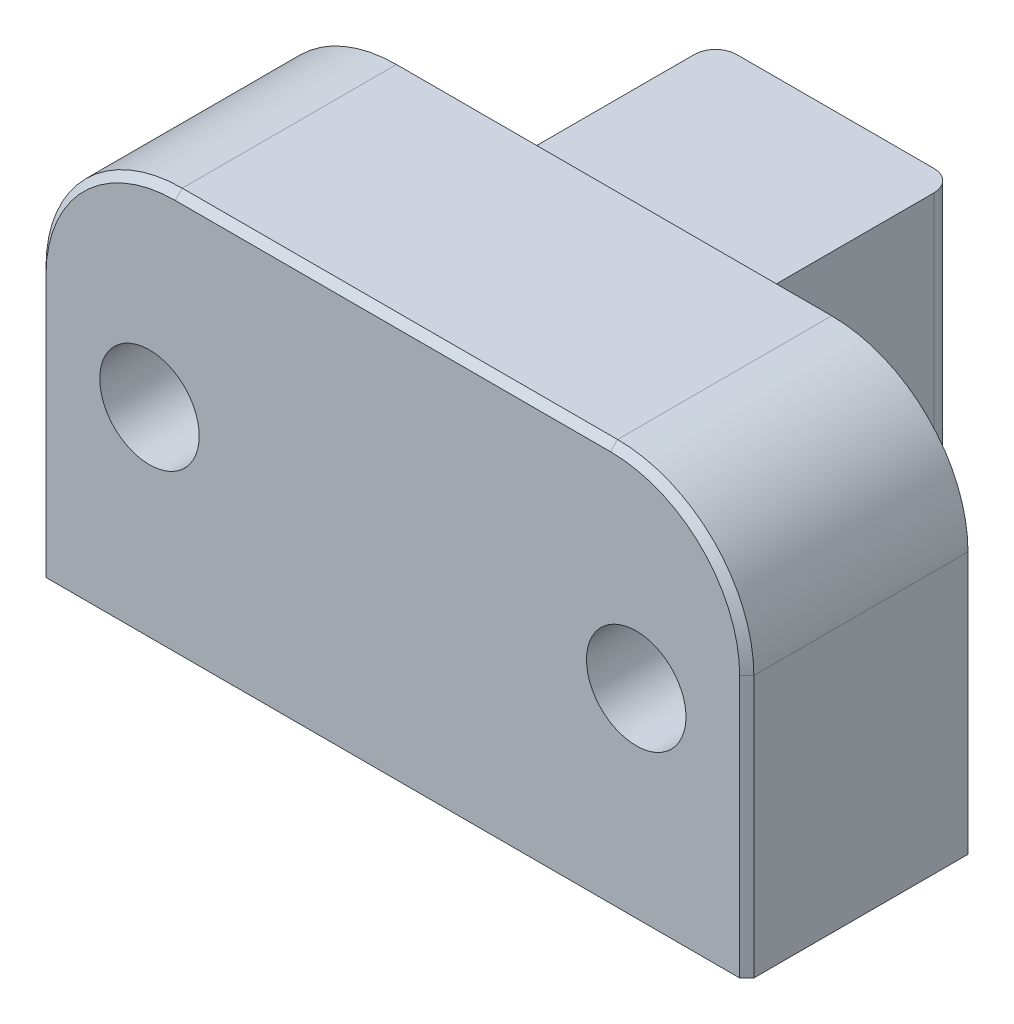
ISO-10303-21;
HEADER;
FILE_DESCRIPTION(('STEP AP214'),'2;1');
FILE_NAME('part.step','',(''),(''),'','','');
FILE_SCHEMA(('AUTOMOTIVE_DESIGN { 1 0 10303 214 1 1 1 1 }'));
ENDSEC;
DATA;
#1=APPLICATION_CONTEXT('core data for automotive mechanical design processes');
#2=APPLICATION_PROTOCOL_DEFINITION('international standard','automotive_design',2000,#1);
#3=PRODUCT_CONTEXT('',#1,'mechanical');
#4=PRODUCT('Part','Part','',(#3));
#5=PRODUCT_RELATED_PRODUCT_CATEGORY('part','',(#4));
#6=PRODUCT_DEFINITION_FORMATION('','',#4);
#7=PRODUCT_DEFINITION_CONTEXT('part definition',#1,'design');
#8=PRODUCT_DEFINITION('design','',#6,#7);
#9=PRODUCT_DEFINITION_SHAPE('','',#8);
#10=(LENGTH_UNIT() NAMED_UNIT(*) SI_UNIT(.MILLI.,.METRE.));
#11=(NAMED_UNIT(*) PLANE_ANGLE_UNIT() SI_UNIT($,.RADIAN.));
#12=(NAMED_UNIT(*) SI_UNIT($,.STERADIAN.) SOLID_ANGLE_UNIT());
#13=UNCERTAINTY_MEASURE_WITH_UNIT(LENGTH_MEASURE(1.E-05),#10,'distance_accuracy_value','');
#14=(GEOMETRIC_REPRESENTATION_CONTEXT(3) GLOBAL_UNCERTAINTY_ASSIGNED_CONTEXT((#13)) GLOBAL_UNIT_ASSIGNED_CONTEXT((#10,
#11,#12)) REPRESENTATION_CONTEXT('',''));
#15=CARTESIAN_POINT('',(0.,0.,0.));
#16=DIRECTION('',(0.,0.,1.));
#17=DIRECTION('',(1.,0.,0.));
#18=AXIS2_PLACEMENT_3D('',#15,#16,#17);
#19=CARTESIAN_POINT('',(-25.39365,28.575,0.));
#20=DIRECTION('',(1.,0.,0.));
#21=DIRECTION('',(0.,0.,-1.));
#22=AXIS2_PLACEMENT_3D('',#19,#20,#21);
#23=PLANE('',#22);
#24=DIRECTION('',(0.,0.,1.));
#25=VECTOR('',#24,1.);
#26=CARTESIAN_POINT('',(-25.39365,0.,0.));
#27=LINE('',#26,#25);
#28=CARTESIAN_POINT('',(-25.39365,0.,0.));
#29=VERTEX_POINT('',#28);
#30=CARTESIAN_POINT('',(-25.39365,0.,15.367));
#31=VERTEX_POINT('',#30);
#32=EDGE_CURVE('E178',#29,#31,#27,.T.);
#33=ORIENTED_EDGE('',*,*,#32,.T.);
#34=DIRECTION('',(0.,1.,0.));
#35=VECTOR('',#34,1.);
#36=CARTESIAN_POINT('',(-25.39365,28.575,15.367));
#37=LINE('',#36,#35);
#38=CARTESIAN_POINT('',(-25.39365,18.796,15.367));
#39=VERTEX_POINT('',#38);
#40=EDGE_CURVE('E252',#31,#39,#37,.T.);
#41=ORIENTED_EDGE('',*,*,#40,.T.);
#42=DIRECTION('',(0.,0.,1.));
#43=VECTOR('',#42,1.);
#44=CARTESIAN_POINT('',(-25.39365,18.796,0.));
#45=LINE('',#44,#43);
#46=CARTESIAN_POINT('',(-25.39365,18.796,0.));
#47=VERTEX_POINT('',#46);
#48=EDGE_CURVE('E235',#39,#47,#45,.F.);
#49=ORIENTED_EDGE('',*,*,#48,.T.);
#50=DIRECTION('',(0.,-1.,0.));
#51=VECTOR('',#50,1.);
#52=CARTESIAN_POINT('',(-25.39365,28.575,0.));
#53=LINE('',#52,#51);
#54=EDGE_CURVE('E173',#47,#29,#53,.T.);
#55=ORIENTED_EDGE('',*,*,#54,.T.);
#56=EDGE_LOOP('',(#33,#41,#49,#55));
#57=FACE_BOUND('',#56,.T.);
#58=ADVANCED_FACE('F32',(#57),#23,.F.);
#59=CARTESIAN_POINT('',(-25.39365,28.575,15.875));
#60=DIRECTION('',(0.,0.,-1.));
#61=DIRECTION('',(-1.,0.,0.));
#62=AXIS2_PLACEMENT_3D('',#59,#60,#61);
#63=PLANE('',#62);
#64=CARTESIAN_POINT('',(17.4625,14.2875,15.875));
#65=DIRECTION('',(0.,0.,-1.));
#66=DIRECTION('',(-1.,0.,0.));
#67=AXIS2_PLACEMENT_3D('',#64,#65,#66);
#68=CIRCLE('',#67,3.5687);
#69=CARTESIAN_POINT('',(13.8938,14.2875,15.875));
#70=VERTEX_POINT('',#69);
#71=EDGE_CURVE('E284',#70,#70,#68,.T.);
#72=ORIENTED_EDGE('',*,*,#71,.T.);
#73=EDGE_LOOP('',(#72));
#74=FACE_BOUND('',#73,.T.);
#75=CARTESIAN_POINT('',(-17.4625,14.2875,15.875));
#76=DIRECTION('',(0.,0.,1.));
#77=DIRECTION('',(1.,0.,0.));
#78=AXIS2_PLACEMENT_3D('',#75,#76,#77);
#79=CIRCLE('',#78,3.5687);
#80=CARTESIAN_POINT('',(-13.8938,14.2875,15.875));
#81=VERTEX_POINT('',#80);
#82=EDGE_CURVE('E296',#81,#81,#79,.T.);
#83=ORIENTED_EDGE('',*,*,#82,.F.);
#84=EDGE_LOOP('',(#83));
#85=FACE_BOUND('',#84,.T.);
#86=CARTESIAN_POINT('',(-15.61465,18.796,15.875));
#87=DIRECTION('',(0.,0.,-1.));
#88=DIRECTION('',(-1.,0.,0.));
#89=AXIS2_PLACEMENT_3D('',#86,#87,#88);
#90=CIRCLE('',#89,9.271);
#91=CARTESIAN_POINT('',(-15.61465,28.067,15.875));
#92=VERTEX_POINT('',#91);
#93=CARTESIAN_POINT('',(-24.88565,18.796,15.875));
#94=VERTEX_POINT('',#93);
#95=EDGE_CURVE('E243',#92,#94,#90,.F.);
#96=ORIENTED_EDGE('',*,*,#95,.T.);
#97=DIRECTION('',(0.,-1.,0.));
#98=VECTOR('',#97,1.);
#99=CARTESIAN_POINT('',(-24.88565,28.575,15.875));
#100=LINE('',#99,#98);
#101=CARTESIAN_POINT('',(-24.88565,0.,15.875));
#102=VERTEX_POINT('',#101);
#103=EDGE_CURVE('E245',#94,#102,#100,.T.);
#104=ORIENTED_EDGE('',*,*,#103,.T.);
#105=DIRECTION('',(1.,0.,0.));
#106=VECTOR('',#105,1.);
#107=CARTESIAN_POINT('',(-25.39365,0.,15.875));
#108=LINE('',#107,#106);
#109=CARTESIAN_POINT('',(24.88565,0.,15.875));
#110=VERTEX_POINT('',#109);
#111=EDGE_CURVE('E162',#102,#110,#108,.T.);
#112=ORIENTED_EDGE('',*,*,#111,.T.);
#113=DIRECTION('',(0.,1.,0.));
#114=VECTOR('',#113,1.);
#115=CARTESIAN_POINT('',(24.88565,28.575,15.875));
#116=LINE('',#115,#114);
#117=CARTESIAN_POINT('',(24.88565,18.796,15.875));
#118=VERTEX_POINT('',#117);
#119=EDGE_CURVE('E237',#110,#118,#116,.T.);
#120=ORIENTED_EDGE('',*,*,#119,.T.);
#121=CARTESIAN_POINT('',(15.61465,18.796,15.875));
#122=DIRECTION('',(0.,0.,-1.));
#123=DIRECTION('',(-1.,0.,0.));
#124=AXIS2_PLACEMENT_3D('',#121,#122,#123);
#125=CIRCLE('',#124,9.271);
#126=CARTESIAN_POINT('',(15.61465,28.067,15.875));
#127=VERTEX_POINT('',#126);
#128=EDGE_CURVE('E239',#118,#127,#125,.F.);
#129=ORIENTED_EDGE('',*,*,#128,.T.);
#130=DIRECTION('',(-1.,0.,0.));
#131=VECTOR('',#130,1.);
#132=CARTESIAN_POINT('',(-15.61465,28.067,15.875));
#133=LINE('',#132,#131);
#134=EDGE_CURVE('E241',#127,#92,#133,.T.);
#135=ORIENTED_EDGE('',*,*,#134,.T.);
#136=EDGE_LOOP('',(#96,#104,#112,#120,#129,#135));
#137=FACE_BOUND('',#136,.T.);
#138=ADVANCED_FACE('F322',(#74,#85,#137),#63,.F.);
#139=CARTESIAN_POINT('',(25.39365,28.575,0.));
#140=DIRECTION('',(-1.,0.,0.));
#141=DIRECTION('',(0.,0.,1.));
#142=AXIS2_PLACEMENT_3D('',#139,#140,#141);
#143=PLANE('',#142);
#144=DIRECTION('',(0.,0.,-1.));
#145=VECTOR('',#144,1.);
#146=CARTESIAN_POINT('',(25.39365,18.796,15.875));
#147=LINE('',#146,#145);
#148=CARTESIAN_POINT('',(25.39365,18.796,0.));
#149=VERTEX_POINT('',#148);
#150=CARTESIAN_POINT('',(25.39365,18.796,15.367));
#151=VERTEX_POINT('',#150);
#152=EDGE_CURVE('E233',#149,#151,#147,.F.);
#153=ORIENTED_EDGE('',*,*,#152,.T.);
#154=DIRECTION('',(0.,-1.,0.));
#155=VECTOR('',#154,1.);
#156=CARTESIAN_POINT('',(25.39365,28.575,15.367));
#157=LINE('',#156,#155);
#158=CARTESIAN_POINT('',(25.39365,0.,15.367));
#159=VERTEX_POINT('',#158);
#160=EDGE_CURVE('E11',#151,#159,#157,.T.);
#161=ORIENTED_EDGE('',*,*,#160,.T.);
#162=DIRECTION('',(0.,0.,-1.));
#163=VECTOR('',#162,1.);
#164=CARTESIAN_POINT('',(25.39365,0.,0.));
#165=LINE('',#164,#163);
#166=CARTESIAN_POINT('',(25.39365,0.,0.));
#167=VERTEX_POINT('',#166);
#168=EDGE_CURVE('E153',#159,#167,#165,.T.);
#169=ORIENTED_EDGE('',*,*,#168,.T.);
#170=DIRECTION('',(0.,-1.,0.));
#171=VECTOR('',#170,1.);
#172=CARTESIAN_POINT('',(25.39365,28.575,0.));
#173=LINE('',#172,#171);
#174=EDGE_CURVE('E156',#149,#167,#173,.T.);
#175=ORIENTED_EDGE('',*,*,#174,.F.);
#176=EDGE_LOOP('',(#153,#161,#169,#175));
#177=FACE_BOUND('',#176,.T.);
#178=ADVANCED_FACE('F155',(#177),#143,.F.);
#179=CARTESIAN_POINT('',(8.59790000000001,28.575,-15.875));
#180=DIRECTION('',(-1.,0.,0.));
#181=DIRECTION('',(0.,0.,1.));
#182=AXIS2_PLACEMENT_3D('',#179,#180,#181);
#183=PLANE('',#182);
#184=DIRECTION('',(0.,0.,1.));
#185=VECTOR('',#184,1.);
#186=CARTESIAN_POINT('',(8.59790000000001,25.527,-15.875));
#187=LINE('',#186,#185);
#188=CARTESIAN_POINT('',(8.59790000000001,25.527,-14.351));
#189=VERTEX_POINT('',#188);
#190=CARTESIAN_POINT('',(8.59790000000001,25.527,-0.787400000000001));
#191=VERTEX_POINT('',#190);
#192=EDGE_CURVE('E306',#189,#191,#187,.T.);
#193=ORIENTED_EDGE('',*,*,#192,.T.);
#194=DIRECTION('',(0.,-1.,0.));
#195=VECTOR('',#194,1.);
#196=CARTESIAN_POINT('',(8.59790000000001,3.048,-0.787400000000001));
#197=LINE('',#196,#195);
#198=CARTESIAN_POINT('',(8.59790000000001,3.048,-0.787400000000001));
#199=VERTEX_POINT('',#198);
#200=EDGE_CURVE('E213',#191,#199,#197,.T.);
#201=ORIENTED_EDGE('',*,*,#200,.T.);
#202=DIRECTION('',(0.,0.,-1.));
#203=VECTOR('',#202,1.);
#204=CARTESIAN_POINT('',(8.59790000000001,3.048,-15.875));
#205=LINE('',#204,#203);
#206=CARTESIAN_POINT('',(8.59790000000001,3.048,-14.351));
#207=VERTEX_POINT('',#206);
#208=EDGE_CURVE('E317',#199,#207,#205,.T.);
#209=ORIENTED_EDGE('',*,*,#208,.T.);
#210=DIRECTION('',(0.,-1.,0.));
#211=VECTOR('',#210,1.);
#212=CARTESIAN_POINT('',(8.59790000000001,28.575,-14.351));
#213=LINE('',#212,#211);
#214=EDGE_CURVE('E195',#207,#189,#213,.F.);
#215=ORIENTED_EDGE('',*,*,#214,.T.);
#216=EDGE_LOOP('',(#193,#201,#209,#215));
#217=FACE_BOUND('',#216,.T.);
#218=ADVANCED_FACE('F400',(#217),#183,.F.);
#219=CARTESIAN_POINT('',(-8.5979,28.575,-15.875));
#220=DIRECTION('',(0.,0.,1.));
#221=DIRECTION('',(1.,0.,0.));
#222=AXIS2_PLACEMENT_3D('',#219,#220,#221);
#223=PLANE('',#222);
#224=DIRECTION('',(1.,0.,0.));
#225=VECTOR('',#224,1.);
#226=CARTESIAN_POINT('',(-8.5979,25.527,-15.875));
#227=LINE('',#226,#225);
#228=CARTESIAN_POINT('',(-7.07389999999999,25.527,-15.875));
#229=VERTEX_POINT('',#228);
#230=CARTESIAN_POINT('',(7.0739,25.527,-15.875));
#231=VERTEX_POINT('',#230);
#232=EDGE_CURVE('E303',#229,#231,#227,.T.);
#233=ORIENTED_EDGE('',*,*,#232,.T.);
#234=DIRECTION('',(0.,-1.,0.));
#235=VECTOR('',#234,1.);
#236=CARTESIAN_POINT('',(7.0739,28.575,-15.875));
#237=LINE('',#236,#235);
#238=CARTESIAN_POINT('',(7.0739,3.048,-15.875));
#239=VERTEX_POINT('',#238);
#240=EDGE_CURVE('E187',#231,#239,#237,.T.);
#241=ORIENTED_EDGE('',*,*,#240,.T.);
#242=DIRECTION('',(-1.,0.,0.));
#243=VECTOR('',#242,1.);
#244=CARTESIAN_POINT('',(-8.5979,3.048,-15.875));
#245=LINE('',#244,#243);
#246=CARTESIAN_POINT('',(-7.07389999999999,3.048,-15.875));
#247=VERTEX_POINT('',#246);
#248=EDGE_CURVE('E314',#239,#247,#245,.T.);
#249=ORIENTED_EDGE('',*,*,#248,.T.);
#250=DIRECTION('',(0.,-1.,0.));
#251=VECTOR('',#250,1.);
#252=CARTESIAN_POINT('',(-7.07389999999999,28.575,-15.875));
#253=LINE('',#252,#251);
#254=EDGE_CURVE('E172',#247,#229,#253,.F.);
#255=ORIENTED_EDGE('',*,*,#254,.T.);
#256=EDGE_LOOP('',(#233,#241,#249,#255));
#257=FACE_BOUND('',#256,.T.);
#258=ADVANCED_FACE('F405',(#257),#223,.F.);
#259=CARTESIAN_POINT('',(-8.5979,28.575,-15.875));
#260=DIRECTION('',(1.,0.,0.));
#261=DIRECTION('',(0.,0.,-1.));
#262=AXIS2_PLACEMENT_3D('',#259,#260,#261);
#263=PLANE('',#262);
#264=DIRECTION('',(0.,0.,1.));
#265=VECTOR('',#264,1.);
#266=CARTESIAN_POINT('',(-8.5979,3.048,-15.875));
#267=LINE('',#266,#265);
#268=CARTESIAN_POINT('',(-8.5979,3.048,-14.351));
#269=VERTEX_POINT('',#268);
#270=CARTESIAN_POINT('',(-8.5979,3.048,-0.787400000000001));
#271=VERTEX_POINT('',#270);
#272=EDGE_CURVE('E311',#269,#271,#267,.T.);
#273=ORIENTED_EDGE('',*,*,#272,.T.);
#274=DIRECTION('',(0.,-1.,0.));
#275=VECTOR('',#274,1.);
#276=CARTESIAN_POINT('',(-8.5979,25.527,-0.7874));
#277=LINE('',#276,#275);
#278=CARTESIAN_POINT('',(-8.5979,25.527,-0.787400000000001));
#279=VERTEX_POINT('',#278);
#280=EDGE_CURVE('E211',#271,#279,#277,.F.);
#281=ORIENTED_EDGE('',*,*,#280,.T.);
#282=DIRECTION('',(0.,0.,-1.));
#283=VECTOR('',#282,1.);
#284=CARTESIAN_POINT('',(-8.5979,25.527,-15.875));
#285=LINE('',#284,#283);
#286=CARTESIAN_POINT('',(-8.5979,25.527,-14.351));
#287=VERTEX_POINT('',#286);
#288=EDGE_CURVE('E301',#279,#287,#285,.T.);
#289=ORIENTED_EDGE('',*,*,#288,.T.);
#290=DIRECTION('',(0.,-1.,0.));
#291=VECTOR('',#290,1.);
#292=CARTESIAN_POINT('',(-8.5979,28.575,-14.351));
#293=LINE('',#292,#291);
#294=EDGE_CURVE('E202',#287,#269,#293,.T.);
#295=ORIENTED_EDGE('',*,*,#294,.T.);
#296=EDGE_LOOP('',(#273,#281,#289,#295));
#297=FACE_BOUND('',#296,.T.);
#298=ADVANCED_FACE('F389',(#297),#263,.F.);
#299=CARTESIAN_POINT('',(-25.39365,28.575,0.));
#300=DIRECTION('',(0.,0.,1.));
#301=DIRECTION('',(1.,0.,0.));
#302=AXIS2_PLACEMENT_3D('',#299,#300,#301);
#303=PLANE('',#302);
#304=CARTESIAN_POINT('',(17.4625,14.2875,0.));
#305=DIRECTION('',(0.,0.,-1.));
#306=DIRECTION('',(-1.,0.,0.));
#307=AXIS2_PLACEMENT_3D('',#304,#305,#306);
#308=CIRCLE('',#307,5.1562);
#309=CARTESIAN_POINT('',(12.3063,14.2875,0.));
#310=VERTEX_POINT('',#309);
#311=EDGE_CURVE('E269',#310,#310,#308,.T.);
#312=ORIENTED_EDGE('',*,*,#311,.F.);
#313=EDGE_LOOP('',(#312));
#314=FACE_BOUND('',#313,.T.);
#315=CARTESIAN_POINT('',(-17.4625,14.2875,0.));
#316=DIRECTION('',(0.,0.,1.));
#317=DIRECTION('',(1.,0.,0.));
#318=AXIS2_PLACEMENT_3D('',#315,#316,#317);
#319=CIRCLE('',#318,5.1562);
#320=CARTESIAN_POINT('',(-12.3063,14.2875,0.));
#321=VERTEX_POINT('',#320);
#322=EDGE_CURVE('E287',#321,#321,#319,.T.);
#323=ORIENTED_EDGE('',*,*,#322,.T.);
#324=EDGE_LOOP('',(#323));
#325=FACE_BOUND('',#324,.T.);
#326=DIRECTION('',(0.,-1.,0.));
#327=VECTOR('',#326,1.);
#328=CARTESIAN_POINT('',(-9.3853,3.048,0.));
#329=LINE('',#328,#327);
#330=CARTESIAN_POINT('',(-9.3853,25.527,0.));
#331=VERTEX_POINT('',#330);
#332=CARTESIAN_POINT('',(-9.3853,3.048,0.));
#333=VERTEX_POINT('',#332);
#334=EDGE_CURVE('E208',#331,#333,#329,.T.);
#335=ORIENTED_EDGE('',*,*,#334,.T.);
#336=DIRECTION('',(1.,0.,0.));
#337=VECTOR('',#336,1.);
#338=CARTESIAN_POINT('',(-12.7,3.048,0.));
#339=LINE('',#338,#337);
#340=CARTESIAN_POINT('',(9.38530000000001,3.048,0.));
#341=VERTEX_POINT('',#340);
#342=EDGE_CURVE('E309',#333,#341,#339,.T.);
#343=ORIENTED_EDGE('',*,*,#342,.T.);
#344=DIRECTION('',(0.,-1.,0.));
#345=VECTOR('',#344,1.);
#346=CARTESIAN_POINT('',(9.38530000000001,25.527,0.));
#347=LINE('',#346,#345);
#348=CARTESIAN_POINT('',(9.38530000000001,25.527,0.));
#349=VERTEX_POINT('',#348);
#350=EDGE_CURVE('E205',#341,#349,#347,.F.);
#351=ORIENTED_EDGE('',*,*,#350,.T.);
#352=DIRECTION('',(1.,0.,0.));
#353=VECTOR('',#352,1.);
#354=CARTESIAN_POINT('',(-12.7,25.527,0.));
#355=LINE('',#354,#353);
#356=EDGE_CURVE('E299',#331,#349,#355,.T.);
#357=ORIENTED_EDGE('',*,*,#356,.F.);
#358=EDGE_LOOP('',(#335,#343,#351,#357));
#359=FACE_BOUND('',#358,.T.);
#360=DIRECTION('',(-1.,0.,0.));
#361=VECTOR('',#360,1.);
#362=CARTESIAN_POINT('',(8.59790000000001,28.575,0.));
#363=LINE('',#362,#361);
#364=CARTESIAN_POINT('',(15.61465,28.575,0.));
#365=VERTEX_POINT('',#364);
#366=CARTESIAN_POINT('',(-15.61465,28.575,0.));
#367=VERTEX_POINT('',#366);
#368=EDGE_CURVE('E179',#365,#367,#363,.T.);
#369=ORIENTED_EDGE('',*,*,#368,.F.);
#370=CARTESIAN_POINT('',(15.61465,18.796,0.));
#371=DIRECTION('',(0.,0.,1.));
#372=DIRECTION('',(1.,0.,0.));
#373=AXIS2_PLACEMENT_3D('',#370,#371,#372);
#374=CIRCLE('',#373,9.779);
#375=EDGE_CURVE('E171',#365,#149,#374,.F.);
#376=ORIENTED_EDGE('',*,*,#375,.T.);
#377=ORIENTED_EDGE('',*,*,#174,.T.);
#378=DIRECTION('',(-1.,0.,0.));
#379=VECTOR('',#378,1.);
#380=CARTESIAN_POINT('',(-25.39365,0.,0.));
#381=LINE('',#380,#379);
#382=EDGE_CURVE('E161',#167,#29,#381,.T.);
#383=ORIENTED_EDGE('',*,*,#382,.T.);
#384=ORIENTED_EDGE('',*,*,#54,.F.);
#385=CARTESIAN_POINT('',(-15.61465,18.796,0.));
#386=DIRECTION('',(0.,0.,1.));
#387=DIRECTION('',(1.,0.,0.));
#388=AXIS2_PLACEMENT_3D('',#385,#386,#387);
#389=CIRCLE('',#388,9.779);
#390=EDGE_CURVE('E230',#47,#367,#389,.F.);
#391=ORIENTED_EDGE('',*,*,#390,.T.);
#392=EDGE_LOOP('',(#369,#376,#377,#383,#384,#391));
#393=FACE_BOUND('',#392,.T.);
#394=ADVANCED_FACE('F167',(#314,#325,#359,#393),#303,.F.);
#395=CARTESIAN_POINT('',(-25.39365,28.575,15.875));
#396=DIRECTION('',(0.,1.,0.));
#397=DIRECTION('',(0.,0.,1.));
#398=AXIS2_PLACEMENT_3D('',#395,#396,#397);
#399=PLANE('',#398);
#400=DIRECTION('',(0.,0.,1.));
#401=VECTOR('',#400,1.);
#402=CARTESIAN_POINT('',(-15.61465,28.575,15.875));
#403=LINE('',#402,#401);
#404=CARTESIAN_POINT('',(-15.61465,28.575,15.367));
#405=VERTEX_POINT('',#404);
#406=EDGE_CURVE('E226',#367,#405,#403,.T.);
#407=ORIENTED_EDGE('',*,*,#406,.T.);
#408=DIRECTION('',(1.,0.,0.));
#409=VECTOR('',#408,1.);
#410=CARTESIAN_POINT('',(15.61465,28.575,15.367));
#411=LINE('',#410,#409);
#412=CARTESIAN_POINT('',(15.61465,28.575,15.367));
#413=VERTEX_POINT('',#412);
#414=EDGE_CURVE('E56',#405,#413,#411,.T.);
#415=ORIENTED_EDGE('',*,*,#414,.T.);
#416=DIRECTION('',(0.,0.,-1.));
#417=VECTOR('',#416,1.);
#418=CARTESIAN_POINT('',(15.61465,28.575,0.));
#419=LINE('',#418,#417);
#420=EDGE_CURVE('E228',#413,#365,#419,.T.);
#421=ORIENTED_EDGE('',*,*,#420,.T.);
#422=ORIENTED_EDGE('',*,*,#368,.T.);
#423=EDGE_LOOP('',(#407,#415,#421,#422));
#424=FACE_BOUND('',#423,.T.);
#425=ADVANCED_FACE('F342',(#424),#399,.T.);
#426=CARTESIAN_POINT('',(-25.39365,0.,15.875));
#427=DIRECTION('',(0.,1.,0.));
#428=DIRECTION('',(0.,0.,1.));
#429=AXIS2_PLACEMENT_3D('',#426,#427,#428);
#430=PLANE('',#429);
#431=ORIENTED_EDGE('',*,*,#111,.F.);
#432=DIRECTION('',(0.707106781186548,0.,0.707106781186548));
#433=VECTOR('',#432,1.);
#434=CARTESIAN_POINT('',(-24.88565,0.,15.875));
#435=LINE('',#434,#433);
#436=EDGE_CURVE('E250',#102,#31,#435,.F.);
#437=ORIENTED_EDGE('',*,*,#436,.T.);
#438=ORIENTED_EDGE('',*,*,#32,.F.);
#439=ORIENTED_EDGE('',*,*,#382,.F.);
#440=ORIENTED_EDGE('',*,*,#168,.F.);
#441=DIRECTION('',(0.707106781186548,0.,-0.707106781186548));
#442=VECTOR('',#441,1.);
#443=CARTESIAN_POINT('',(25.39365,0.,15.367));
#444=LINE('',#443,#442);
#445=EDGE_CURVE('E248',#159,#110,#444,.F.);
#446=ORIENTED_EDGE('',*,*,#445,.T.);
#447=EDGE_LOOP('',(#431,#437,#438,#439,#440,#446));
#448=FACE_BOUND('',#447,.T.);
#449=ADVANCED_FACE('F176',(#448),#430,.F.);
#450=CARTESIAN_POINT('',(-12.7,3.048,-25.4));
#451=DIRECTION('',(0.,1.,0.));
#452=DIRECTION('',(0.,0.,1.));
#453=AXIS2_PLACEMENT_3D('',#450,#451,#452);
#454=PLANE('',#453);
#455=ORIENTED_EDGE('',*,*,#248,.F.);
#456=CARTESIAN_POINT('',(7.0739,3.048,-14.351));
#457=DIRECTION('',(0.,1.,0.));
#458=DIRECTION('',(0.,0.,1.));
#459=AXIS2_PLACEMENT_3D('',#456,#457,#458);
#460=CIRCLE('',#459,1.524);
#461=EDGE_CURVE('E192',#239,#207,#460,.F.);
#462=ORIENTED_EDGE('',*,*,#461,.T.);
#463=ORIENTED_EDGE('',*,*,#208,.F.);
#464=CARTESIAN_POINT('',(9.38530000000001,3.048,-0.787400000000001));
#465=DIRECTION('',(0.,1.,0.));
#466=DIRECTION('',(0.,0.,1.));
#467=AXIS2_PLACEMENT_3D('',#464,#465,#466);
#468=CIRCLE('',#467,0.7874);
#469=EDGE_CURVE('E221',#199,#341,#468,.T.);
#470=ORIENTED_EDGE('',*,*,#469,.T.);
#471=ORIENTED_EDGE('',*,*,#342,.F.);
#472=CARTESIAN_POINT('',(-9.3853,3.048,-0.7874));
#473=DIRECTION('',(0.,1.,0.));
#474=DIRECTION('',(0.,0.,1.));
#475=AXIS2_PLACEMENT_3D('',#472,#473,#474);
#476=CIRCLE('',#475,0.7874);
#477=EDGE_CURVE('E216',#333,#271,#476,.T.);
#478=ORIENTED_EDGE('',*,*,#477,.T.);
#479=ORIENTED_EDGE('',*,*,#272,.F.);
#480=CARTESIAN_POINT('',(-7.07389999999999,3.048,-14.351));
#481=DIRECTION('',(0.,1.,0.));
#482=DIRECTION('',(0.,0.,1.));
#483=AXIS2_PLACEMENT_3D('',#480,#481,#482);
#484=CIRCLE('',#483,1.524);
#485=EDGE_CURVE('E190',#269,#247,#484,.F.);
#486=ORIENTED_EDGE('',*,*,#485,.T.);
#487=EDGE_LOOP('',(#455,#462,#463,#470,#471,#478,#479,#486));
#488=FACE_BOUND('',#487,.T.);
#489=ADVANCED_FACE('F393',(#488),#454,.F.);
#490=CARTESIAN_POINT('',(-12.7,25.527,-25.4));
#491=DIRECTION('',(0.,-1.,0.));
#492=DIRECTION('',(0.,0.,-1.));
#493=AXIS2_PLACEMENT_3D('',#490,#491,#492);
#494=PLANE('',#493);
#495=ORIENTED_EDGE('',*,*,#192,.F.);
#496=CARTESIAN_POINT('',(7.0739,25.527,-14.351));
#497=DIRECTION('',(0.,-1.,0.));
#498=DIRECTION('',(0.,0.,-1.));
#499=AXIS2_PLACEMENT_3D('',#496,#497,#498);
#500=CIRCLE('',#499,1.524);
#501=EDGE_CURVE('E200',#189,#231,#500,.F.);
#502=ORIENTED_EDGE('',*,*,#501,.T.);
#503=ORIENTED_EDGE('',*,*,#232,.F.);
#504=CARTESIAN_POINT('',(-7.07389999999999,25.527,-14.351));
#505=DIRECTION('',(0.,-1.,0.));
#506=DIRECTION('',(0.,0.,-1.));
#507=AXIS2_PLACEMENT_3D('',#504,#505,#506);
#508=CIRCLE('',#507,1.524);
#509=EDGE_CURVE('E197',#229,#287,#508,.F.);
#510=ORIENTED_EDGE('',*,*,#509,.T.);
#511=ORIENTED_EDGE('',*,*,#288,.F.);
#512=CARTESIAN_POINT('',(-9.3853,25.527,-0.7874));
#513=DIRECTION('',(0.,-1.,0.));
#514=DIRECTION('',(0.,0.,-1.));
#515=AXIS2_PLACEMENT_3D('',#512,#513,#514);
#516=CIRCLE('',#515,0.7874);
#517=EDGE_CURVE('E218',#279,#331,#516,.T.);
#518=ORIENTED_EDGE('',*,*,#517,.T.);
#519=ORIENTED_EDGE('',*,*,#356,.T.);
#520=CARTESIAN_POINT('',(9.38530000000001,25.527,-0.787400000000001));
#521=DIRECTION('',(0.,-1.,0.));
#522=DIRECTION('',(0.,0.,-1.));
#523=AXIS2_PLACEMENT_3D('',#520,#521,#522);
#524=CIRCLE('',#523,0.7874);
#525=EDGE_CURVE('E224',#349,#191,#524,.T.);
#526=ORIENTED_EDGE('',*,*,#525,.T.);
#527=EDGE_LOOP('',(#495,#502,#503,#510,#511,#518,#519,#526));
#528=FACE_BOUND('',#527,.T.);
#529=ADVANCED_FACE('F369',(#528),#494,.F.);
#530=CARTESIAN_POINT('',(7.0739,28.575,-14.351));
#531=DIRECTION('',(0.,-1.,0.));
#532=DIRECTION('',(0.,0.,-1.));
#533=AXIS2_PLACEMENT_3D('',#530,#531,#532);
#534=CYLINDRICAL_SURFACE('',#533,1.524);
#535=ORIENTED_EDGE('',*,*,#501,.F.);
#536=ORIENTED_EDGE('',*,*,#214,.F.);
#537=ORIENTED_EDGE('',*,*,#461,.F.);
#538=ORIENTED_EDGE('',*,*,#240,.F.);
#539=EDGE_LOOP('',(#535,#536,#537,#538));
#540=FACE_BOUND('',#539,.T.);
#541=ADVANCED_FACE('F365',(#540),#534,.T.);
#542=CARTESIAN_POINT('',(-7.07389999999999,28.575,-14.351));
#543=DIRECTION('',(0.,-1.,0.));
#544=DIRECTION('',(0.,0.,-1.));
#545=AXIS2_PLACEMENT_3D('',#542,#543,#544);
#546=CYLINDRICAL_SURFACE('',#545,1.524);
#547=ORIENTED_EDGE('',*,*,#509,.F.);
#548=ORIENTED_EDGE('',*,*,#254,.F.);
#549=ORIENTED_EDGE('',*,*,#485,.F.);
#550=ORIENTED_EDGE('',*,*,#294,.F.);
#551=EDGE_LOOP('',(#547,#548,#549,#550));
#552=FACE_BOUND('',#551,.T.);
#553=ADVANCED_FACE('F368',(#552),#546,.T.);
#554=CARTESIAN_POINT('',(-9.3853,28.575,-0.7874));
#555=DIRECTION('',(0.,1.,0.));
#556=DIRECTION('',(0.,0.,1.));
#557=AXIS2_PLACEMENT_3D('',#554,#555,#556);
#558=CYLINDRICAL_SURFACE('',#557,0.7874);
#559=ORIENTED_EDGE('',*,*,#517,.F.);
#560=ORIENTED_EDGE('',*,*,#280,.F.);
#561=ORIENTED_EDGE('',*,*,#477,.F.);
#562=ORIENTED_EDGE('',*,*,#334,.F.);
#563=EDGE_LOOP('',(#559,#560,#561,#562));
#564=FACE_BOUND('',#563,.T.);
#565=ADVANCED_FACE('F353',(#564),#558,.F.);
#566=CARTESIAN_POINT('',(9.38530000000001,28.575,-0.787400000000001));
#567=DIRECTION('',(0.,1.,0.));
#568=DIRECTION('',(0.,0.,1.));
#569=AXIS2_PLACEMENT_3D('',#566,#567,#568);
#570=CYLINDRICAL_SURFACE('',#569,0.7874);
#571=ORIENTED_EDGE('',*,*,#525,.F.);
#572=ORIENTED_EDGE('',*,*,#350,.F.);
#573=ORIENTED_EDGE('',*,*,#469,.F.);
#574=ORIENTED_EDGE('',*,*,#200,.F.);
#575=EDGE_LOOP('',(#571,#572,#573,#574));
#576=FACE_BOUND('',#575,.T.);
#577=ADVANCED_FACE('F345',(#576),#570,.F.);
#578=CARTESIAN_POINT('',(15.61465,18.796,15.875));
#579=DIRECTION('',(0.,0.,1.));
#580=DIRECTION('',(1.,0.,0.));
#581=AXIS2_PLACEMENT_3D('',#578,#579,#580);
#582=CYLINDRICAL_SURFACE('',#581,9.779);
#583=ORIENTED_EDGE('',*,*,#420,.F.);
#584=CARTESIAN_POINT('',(15.61465,18.796,15.367));
#585=DIRECTION('',(0.,0.,-1.));
#586=DIRECTION('',(-1.,0.,0.));
#587=AXIS2_PLACEMENT_3D('',#584,#585,#586);
#588=CIRCLE('',#587,9.779);
#589=EDGE_CURVE('E41',#413,#151,#588,.T.);
#590=ORIENTED_EDGE('',*,*,#589,.T.);
#591=ORIENTED_EDGE('',*,*,#152,.F.);
#592=ORIENTED_EDGE('',*,*,#375,.F.);
#593=EDGE_LOOP('',(#583,#590,#591,#592));
#594=FACE_BOUND('',#593,.T.);
#595=ADVANCED_FACE('F343',(#594),#582,.T.);
#596=CARTESIAN_POINT('',(-15.61465,18.796,15.875));
#597=DIRECTION('',(0.,0.,-1.));
#598=DIRECTION('',(-1.,0.,0.));
#599=AXIS2_PLACEMENT_3D('',#596,#597,#598);
#600=CYLINDRICAL_SURFACE('',#599,9.779);
#601=ORIENTED_EDGE('',*,*,#48,.F.);
#602=CARTESIAN_POINT('',(-15.61465,18.796,15.367));
#603=DIRECTION('',(0.,0.,-1.));
#604=DIRECTION('',(-1.,0.,0.));
#605=AXIS2_PLACEMENT_3D('',#602,#603,#604);
#606=CIRCLE('',#605,9.779);
#607=EDGE_CURVE('E254',#39,#405,#606,.T.);
#608=ORIENTED_EDGE('',*,*,#607,.T.);
#609=ORIENTED_EDGE('',*,*,#406,.F.);
#610=ORIENTED_EDGE('',*,*,#390,.F.);
#611=EDGE_LOOP('',(#601,#608,#609,#610));
#612=FACE_BOUND('',#611,.T.);
#613=ADVANCED_FACE('F341',(#612),#600,.T.);
#614=CARTESIAN_POINT('',(-17.4625,14.2875,26.865158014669));
#615=DIRECTION('',(0.,0.,1.));
#616=DIRECTION('',(1.,0.,0.));
#617=AXIS2_PLACEMENT_3D('',#614,#615,#616);
#618=CYLINDRICAL_SURFACE('',#617,3.5687);
#619=CARTESIAN_POINT('',(-17.4625,14.2875,6.7564));
#620=DIRECTION('',(0.,0.,1.));
#621=DIRECTION('',(1.,0.,0.));
#622=AXIS2_PLACEMENT_3D('',#619,#620,#621);
#623=CIRCLE('',#622,3.5687);
#624=CARTESIAN_POINT('',(-13.8938,14.2875,6.7564));
#625=VERTEX_POINT('',#624);
#626=EDGE_CURVE('E293',#625,#625,#623,.T.);
#627=ORIENTED_EDGE('',*,*,#626,.F.);
#628=EDGE_LOOP('',(#627));
#629=FACE_BOUND('',#628,.T.);
#630=ORIENTED_EDGE('',*,*,#82,.T.);
#631=EDGE_LOOP('',(#630));
#632=FACE_BOUND('',#631,.T.);
#633=ADVANCED_FACE('F351',(#629,#632),#618,.F.);
#634=CARTESIAN_POINT('',(-13.8938,14.2875,6.7564));
#635=DIRECTION('',(0.,0.,1.));
#636=DIRECTION('',(1.,0.,0.));
#637=AXIS2_PLACEMENT_3D('',#634,#635,#636);
#638=PLANE('',#637);
#639=CARTESIAN_POINT('',(-17.4625,14.2875,6.7564));
#640=DIRECTION('',(0.,0.,1.));
#641=DIRECTION('',(1.,0.,0.));
#642=AXIS2_PLACEMENT_3D('',#639,#640,#641);
#643=CIRCLE('',#642,5.1562);
#644=CARTESIAN_POINT('',(-12.3063,14.2875,6.7564));
#645=VERTEX_POINT('',#644);
#646=EDGE_CURVE('E290',#645,#645,#643,.T.);
#647=ORIENTED_EDGE('',*,*,#646,.F.);
#648=EDGE_LOOP('',(#647));
#649=FACE_BOUND('',#648,.T.);
#650=ORIENTED_EDGE('',*,*,#626,.T.);
#651=EDGE_LOOP('',(#650));
#652=FACE_BOUND('',#651,.T.);
#653=ADVANCED_FACE('F478',(#649,#652),#638,.F.);
#654=CARTESIAN_POINT('',(-17.4625,14.2875,26.865158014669));
#655=DIRECTION('',(0.,0.,1.));
#656=DIRECTION('',(1.,0.,0.));
#657=AXIS2_PLACEMENT_3D('',#654,#655,#656);
#658=CYLINDRICAL_SURFACE('',#657,5.1562);
#659=ORIENTED_EDGE('',*,*,#322,.F.);
#660=EDGE_LOOP('',(#659));
#661=FACE_BOUND('',#660,.T.);
#662=ORIENTED_EDGE('',*,*,#646,.T.);
#663=EDGE_LOOP('',(#662));
#664=FACE_BOUND('',#663,.T.);
#665=ADVANCED_FACE('F489',(#661,#664),#658,.F.);
#666=CARTESIAN_POINT('',(17.4625,14.2875,26.865158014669));
#667=DIRECTION('',(0.,0.,1.));
#668=DIRECTION('',(-1.,0.,0.));
#669=AXIS2_PLACEMENT_3D('',#666,#667,#668);
#670=CYLINDRICAL_SURFACE('',#669,3.5687);
#671=CARTESIAN_POINT('',(17.4625,14.2875,6.7564));
#672=DIRECTION('',(0.,0.,-1.));
#673=DIRECTION('',(-1.,0.,0.));
#674=AXIS2_PLACEMENT_3D('',#671,#672,#673);
#675=CIRCLE('',#674,3.5687);
#676=CARTESIAN_POINT('',(13.8938,14.2875,6.7564));
#677=VERTEX_POINT('',#676);
#678=EDGE_CURVE('E279',#677,#677,#675,.T.);
#679=ORIENTED_EDGE('',*,*,#678,.T.);
#680=EDGE_LOOP('',(#679));
#681=FACE_BOUND('',#680,.T.);
#682=ORIENTED_EDGE('',*,*,#71,.F.);
#683=EDGE_LOOP('',(#682));
#684=FACE_BOUND('',#683,.T.);
#685=ADVANCED_FACE('F499',(#681,#684),#670,.F.);
#686=CARTESIAN_POINT('',(13.8938,14.2875,6.7564));
#687=DIRECTION('',(0.,0.,1.));
#688=DIRECTION('',(-1.,0.,0.));
#689=AXIS2_PLACEMENT_3D('',#686,#687,#688);
#690=PLANE('',#689);
#691=CARTESIAN_POINT('',(17.4625,14.2875,6.7564));
#692=DIRECTION('',(0.,0.,-1.));
#693=DIRECTION('',(-1.,0.,0.));
#694=AXIS2_PLACEMENT_3D('',#691,#692,#693);
#695=CIRCLE('',#694,5.1562);
#696=CARTESIAN_POINT('',(12.3063,14.2875,6.7564));
#697=VERTEX_POINT('',#696);
#698=EDGE_CURVE('E274',#697,#697,#695,.T.);
#699=ORIENTED_EDGE('',*,*,#698,.T.);
#700=EDGE_LOOP('',(#699));
#701=FACE_BOUND('',#700,.T.);
#702=ORIENTED_EDGE('',*,*,#678,.F.);
#703=EDGE_LOOP('',(#702));
#704=FACE_BOUND('',#703,.T.);
#705=ADVANCED_FACE('F517',(#701,#704),#690,.F.);
#706=CARTESIAN_POINT('',(17.4625,14.2875,26.865158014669));
#707=DIRECTION('',(0.,0.,1.));
#708=DIRECTION('',(-1.,0.,0.));
#709=AXIS2_PLACEMENT_3D('',#706,#707,#708);
#710=CYLINDRICAL_SURFACE('',#709,5.1562);
#711=ORIENTED_EDGE('',*,*,#311,.T.);
#712=EDGE_LOOP('',(#711));
#713=FACE_BOUND('',#712,.T.);
#714=ORIENTED_EDGE('',*,*,#698,.F.);
#715=EDGE_LOOP('',(#714));
#716=FACE_BOUND('',#715,.T.);
#717=ADVANCED_FACE('F527',(#713,#716),#710,.F.);
#718=CARTESIAN_POINT('',(25.39365,28.575,15.367));
#719=DIRECTION('',(-0.707106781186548,0.,-0.707106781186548));
#720=DIRECTION('',(-0.707106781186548,0.,0.707106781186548));
#721=AXIS2_PLACEMENT_3D('',#718,#719,#720);
#722=PLANE('',#721);
#723=ORIENTED_EDGE('',*,*,#445,.F.);
#724=ORIENTED_EDGE('',*,*,#160,.F.);
#725=DIRECTION('',(0.707106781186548,0.,-0.707106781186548));
#726=VECTOR('',#725,1.);
#727=CARTESIAN_POINT('',(24.88565,18.796,15.875));
#728=LINE('',#727,#726);
#729=EDGE_CURVE('E36',#118,#151,#728,.T.);
#730=ORIENTED_EDGE('',*,*,#729,.F.);
#731=ORIENTED_EDGE('',*,*,#119,.F.);
#732=EDGE_LOOP('',(#723,#724,#730,#731));
#733=FACE_BOUND('',#732,.T.);
#734=ADVANCED_FACE('F34',(#733),#722,.F.);
#735=CARTESIAN_POINT('',(15.61465,18.796,15.875));
#736=DIRECTION('',(0.,0.,-1.));
#737=DIRECTION('',(-1.,0.,0.));
#738=AXIS2_PLACEMENT_3D('',#735,#736,#737);
#739=CONICAL_SURFACE('',#738,9.271,0.785398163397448);
#740=ORIENTED_EDGE('',*,*,#729,.T.);
#741=ORIENTED_EDGE('',*,*,#589,.F.);
#742=DIRECTION('',(0.,0.707106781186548,-0.707106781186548));
#743=VECTOR('',#742,1.);
#744=CARTESIAN_POINT('',(15.61465,28.067,15.875));
#745=LINE('',#744,#743);
#746=EDGE_CURVE('E263',#127,#413,#745,.T.);
#747=ORIENTED_EDGE('',*,*,#746,.F.);
#748=ORIENTED_EDGE('',*,*,#128,.F.);
#749=EDGE_LOOP('',(#740,#741,#747,#748));
#750=FACE_BOUND('',#749,.T.);
#751=ADVANCED_FACE('F325',(#750),#739,.T.);
#752=CARTESIAN_POINT('',(-25.39365,28.575,15.367));
#753=DIRECTION('',(0.,0.707106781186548,0.707106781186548));
#754=DIRECTION('',(0.,-0.707106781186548,0.707106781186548));
#755=AXIS2_PLACEMENT_3D('',#752,#753,#754);
#756=PLANE('',#755);
#757=ORIENTED_EDGE('',*,*,#746,.T.);
#758=ORIENTED_EDGE('',*,*,#414,.F.);
#759=DIRECTION('',(0.,0.707106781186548,-0.707106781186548));
#760=VECTOR('',#759,1.);
#761=CARTESIAN_POINT('',(-15.61465,28.067,15.875));
#762=LINE('',#761,#760);
#763=EDGE_CURVE('E261',#92,#405,#762,.T.);
#764=ORIENTED_EDGE('',*,*,#763,.F.);
#765=ORIENTED_EDGE('',*,*,#134,.F.);
#766=EDGE_LOOP('',(#757,#758,#764,#765));
#767=FACE_BOUND('',#766,.T.);
#768=ADVANCED_FACE('F329',(#767),#756,.T.);
#769=CARTESIAN_POINT('',(-15.61465,18.796,15.875));
#770=DIRECTION('',(0.,0.,-1.));
#771=DIRECTION('',(-1.,0.,0.));
#772=AXIS2_PLACEMENT_3D('',#769,#770,#771);
#773=CONICAL_SURFACE('',#772,9.271,0.785398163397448);
#774=ORIENTED_EDGE('',*,*,#763,.T.);
#775=ORIENTED_EDGE('',*,*,#607,.F.);
#776=DIRECTION('',(-0.707106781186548,0.,-0.707106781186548));
#777=VECTOR('',#776,1.);
#778=CARTESIAN_POINT('',(-24.88565,18.796,15.875));
#779=LINE('',#778,#777);
#780=EDGE_CURVE('E258',#94,#39,#779,.T.);
#781=ORIENTED_EDGE('',*,*,#780,.F.);
#782=ORIENTED_EDGE('',*,*,#95,.F.);
#783=EDGE_LOOP('',(#774,#775,#781,#782));
#784=FACE_BOUND('',#783,.T.);
#785=ADVANCED_FACE('F332',(#784),#773,.T.);
#786=CARTESIAN_POINT('',(-24.88565,28.575,15.875));
#787=DIRECTION('',(0.707106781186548,0.,-0.707106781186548));
#788=DIRECTION('',(-0.707106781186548,0.,-0.707106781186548));
#789=AXIS2_PLACEMENT_3D('',#786,#787,#788);
#790=PLANE('',#789);
#791=ORIENTED_EDGE('',*,*,#780,.T.);
#792=ORIENTED_EDGE('',*,*,#40,.F.);
#793=ORIENTED_EDGE('',*,*,#436,.F.);
#794=ORIENTED_EDGE('',*,*,#103,.F.);
#795=EDGE_LOOP('',(#791,#792,#793,#794));
#796=FACE_BOUND('',#795,.T.);
#797=ADVANCED_FACE('F335',(#796),#790,.F.);
#798=CLOSED_SHELL('',(#58,#138,#178,#218,#258,#298,#394,#425,#449,#489,#529,#541,#553,#565,#577,
#595,#613,#633,#653,#665,#685,#705,#717,#734,#751,#768,#785,#797));
#799=MANIFOLD_SOLID_BREP('B2',#798);
#800=ADVANCED_BREP_SHAPE_REPRESENTATION('',(#18,#799),#14);
#801=SHAPE_DEFINITION_REPRESENTATION(#9,#800);
ENDSEC;
END-ISO-10303-21;
